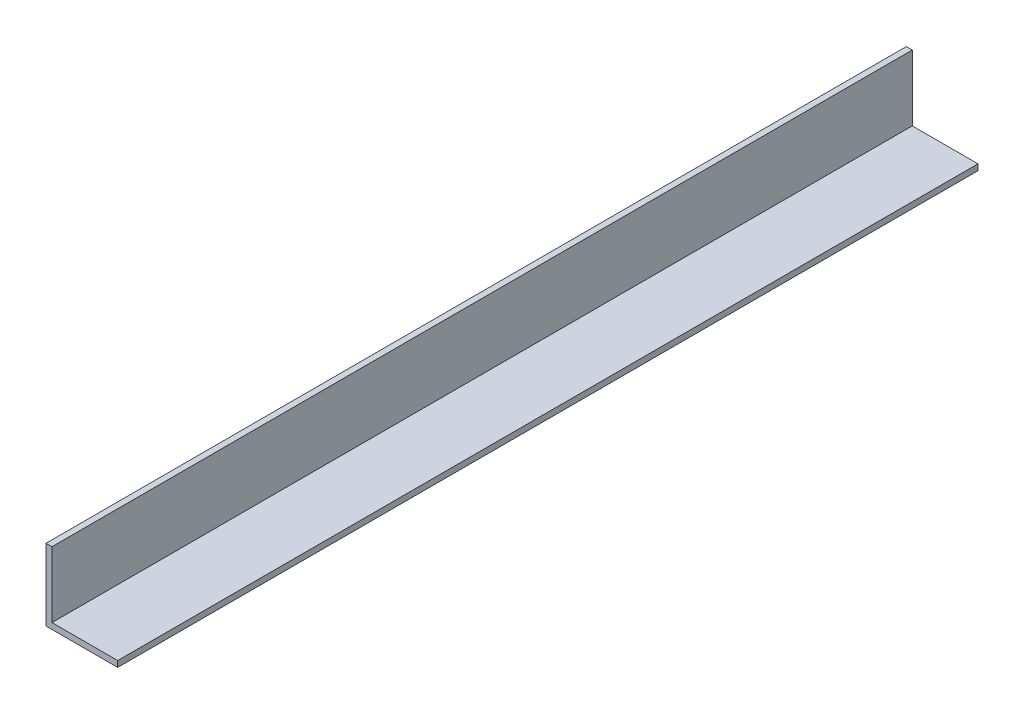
from build123d import *

# Parameters (mm, degrees)
BASE_EXTRUDE_DEPTH = 457.2


with BuildPart() as part:
    # Sketch1 → Base-Extrude (new body)
    with BuildSketch(Plane.XY):
        Polygon((0, 38.1), (0, 0), (38.1, 0), (38.1, 3.175), (3.175, 3.175), (3.175, 38.1), align=None)
    extrude(amount=BASE_EXTRUDE_DEPTH)


solid = part.part
